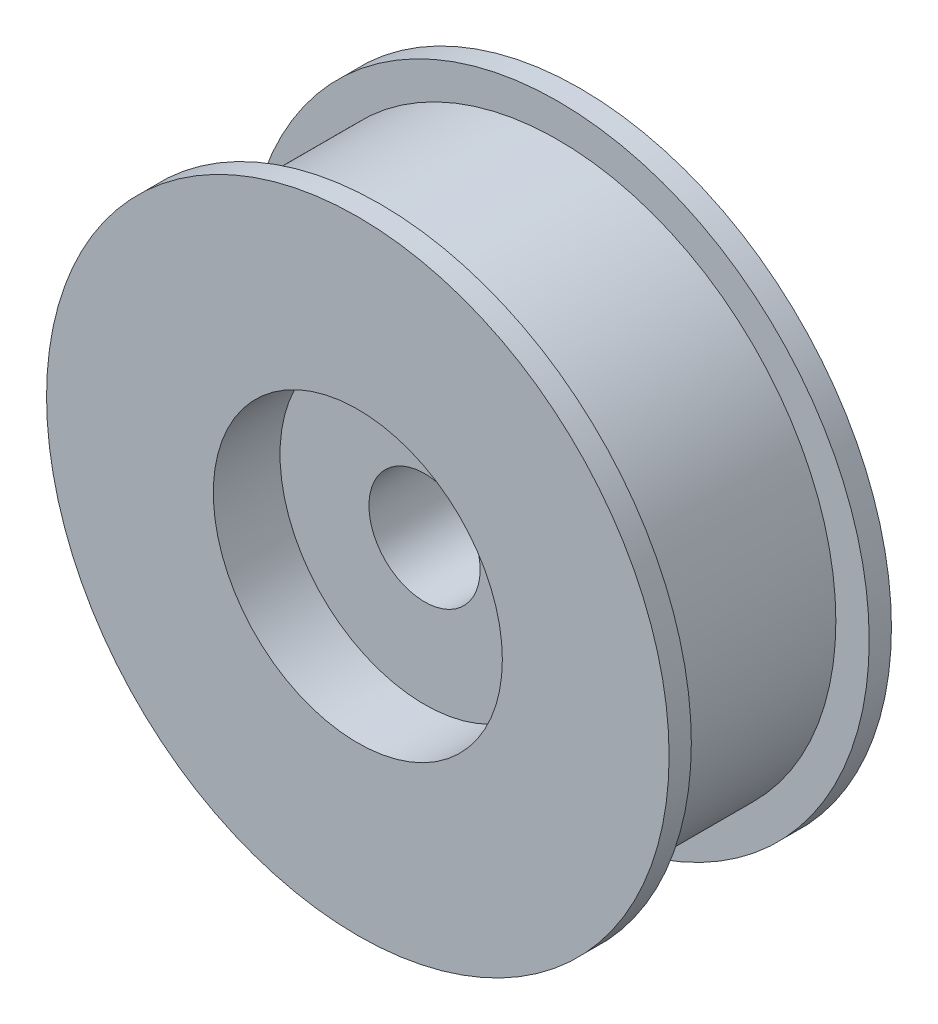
ISO-10303-21;
HEADER;
FILE_DESCRIPTION(('STEP AP214'),'2;1');
FILE_NAME('part.step','',(''),(''),'','','');
FILE_SCHEMA(('AUTOMOTIVE_DESIGN { 1 0 10303 214 1 1 1 1 }'));
ENDSEC;
DATA;
#1=APPLICATION_CONTEXT('core data for automotive mechanical design processes');
#2=APPLICATION_PROTOCOL_DEFINITION('international standard','automotive_design',2000,#1);
#3=PRODUCT_CONTEXT('',#1,'mechanical');
#4=PRODUCT('Part','Part','',(#3));
#5=PRODUCT_RELATED_PRODUCT_CATEGORY('part','',(#4));
#6=PRODUCT_DEFINITION_FORMATION('','',#4);
#7=PRODUCT_DEFINITION_CONTEXT('part definition',#1,'design');
#8=PRODUCT_DEFINITION('design','',#6,#7);
#9=PRODUCT_DEFINITION_SHAPE('','',#8);
#10=(LENGTH_UNIT() NAMED_UNIT(*) SI_UNIT(.MILLI.,.METRE.));
#11=(NAMED_UNIT(*) PLANE_ANGLE_UNIT() SI_UNIT($,.RADIAN.));
#12=(NAMED_UNIT(*) SI_UNIT($,.STERADIAN.) SOLID_ANGLE_UNIT());
#13=UNCERTAINTY_MEASURE_WITH_UNIT(LENGTH_MEASURE(1.E-05),#10,'distance_accuracy_value','');
#14=(GEOMETRIC_REPRESENTATION_CONTEXT(3) GLOBAL_UNCERTAINTY_ASSIGNED_CONTEXT((#13)) GLOBAL_UNIT_ASSIGNED_CONTEXT((#10,
#11,#12)) REPRESENTATION_CONTEXT('',''));
#15=CARTESIAN_POINT('',(0.,0.,0.));
#16=DIRECTION('',(0.,0.,1.));
#17=DIRECTION('',(1.,0.,0.));
#18=AXIS2_PLACEMENT_3D('',#15,#16,#17);
#19=CARTESIAN_POINT('',(0.,0.,20.3646380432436));
#20=DIRECTION('',(0.,0.,1.));
#21=DIRECTION('',(1.,0.,0.));
#22=AXIS2_PLACEMENT_3D('',#19,#20,#21);
#23=CYLINDRICAL_SURFACE('',#22,11.);
#24=CARTESIAN_POINT('',(0.,0.,-10.));
#25=DIRECTION('',(0.,0.,1.));
#26=DIRECTION('',(1.,0.,0.));
#27=AXIS2_PLACEMENT_3D('',#24,#25,#26);
#28=CIRCLE('',#27,11.);
#29=CARTESIAN_POINT('',(11.,0.,-10.));
#30=VERTEX_POINT('',#29);
#31=EDGE_CURVE('E8',#30,#30,#28,.T.);
#32=ORIENTED_EDGE('',*,*,#31,.F.);
#33=EDGE_LOOP('',(#32));
#34=FACE_BOUND('',#33,.T.);
#35=CARTESIAN_POINT('',(0.,0.,-4.));
#36=DIRECTION('',(0.,0.,1.));
#37=DIRECTION('',(1.,0.,0.));
#38=AXIS2_PLACEMENT_3D('',#35,#36,#37);
#39=CIRCLE('',#38,11.);
#40=CARTESIAN_POINT('',(11.,0.,-4.));
#41=VERTEX_POINT('',#40);
#42=EDGE_CURVE('E52',#41,#41,#39,.T.);
#43=ORIENTED_EDGE('',*,*,#42,.T.);
#44=EDGE_LOOP('',(#43));
#45=FACE_BOUND('',#44,.T.);
#46=ADVANCED_FACE('F12',(#34,#45),#23,.F.);
#47=CARTESIAN_POINT('',(0.,11.,-10.));
#48=DIRECTION('',(0.,0.,1.));
#49=DIRECTION('',(1.,0.,0.));
#50=AXIS2_PLACEMENT_3D('',#47,#48,#49);
#51=PLANE('',#50);
#52=CARTESIAN_POINT('',(0.,0.,-10.));
#53=DIRECTION('',(0.,0.,1.));
#54=DIRECTION('',(1.,0.,0.));
#55=AXIS2_PLACEMENT_3D('',#52,#53,#54);
#56=CIRCLE('',#55,28.);
#57=CARTESIAN_POINT('',(28.,0.,-10.));
#58=VERTEX_POINT('',#57);
#59=EDGE_CURVE('E18',#58,#58,#56,.T.);
#60=ORIENTED_EDGE('',*,*,#59,.F.);
#61=EDGE_LOOP('',(#60));
#62=FACE_BOUND('',#61,.T.);
#63=ORIENTED_EDGE('',*,*,#31,.T.);
#64=EDGE_LOOP('',(#63));
#65=FACE_BOUND('',#64,.T.);
#66=ADVANCED_FACE('F113',(#62,#65),#51,.F.);
#67=CARTESIAN_POINT('',(0.,0.,20.3646380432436));
#68=DIRECTION('',(0.,0.,1.));
#69=DIRECTION('',(1.,0.,0.));
#70=AXIS2_PLACEMENT_3D('',#67,#68,#69);
#71=CYLINDRICAL_SURFACE('',#70,28.);
#72=CARTESIAN_POINT('',(0.,0.,-8.));
#73=DIRECTION('',(0.,0.,1.));
#74=DIRECTION('',(1.,0.,0.));
#75=AXIS2_PLACEMENT_3D('',#72,#73,#74);
#76=CIRCLE('',#75,28.);
#77=CARTESIAN_POINT('',(28.,0.,-8.));
#78=VERTEX_POINT('',#77);
#79=EDGE_CURVE('E22',#78,#78,#76,.T.);
#80=ORIENTED_EDGE('',*,*,#79,.F.);
#81=EDGE_LOOP('',(#80));
#82=FACE_BOUND('',#81,.T.);
#83=ORIENTED_EDGE('',*,*,#59,.T.);
#84=EDGE_LOOP('',(#83));
#85=FACE_BOUND('',#84,.T.);
#86=ADVANCED_FACE('F108',(#82,#85),#71,.T.);
#87=CARTESIAN_POINT('',(0.,28.,-8.));
#88=DIRECTION('',(0.,0.,-1.));
#89=DIRECTION('',(-1.,0.,0.));
#90=AXIS2_PLACEMENT_3D('',#87,#88,#89);
#91=PLANE('',#90);
#92=CARTESIAN_POINT('',(0.,0.,-8.));
#93=DIRECTION('',(0.,0.,1.));
#94=DIRECTION('',(1.,0.,0.));
#95=AXIS2_PLACEMENT_3D('',#92,#93,#94);
#96=CIRCLE('',#95,25.);
#97=CARTESIAN_POINT('',(25.,0.,-8.));
#98=VERTEX_POINT('',#97);
#99=EDGE_CURVE('E26',#98,#98,#96,.T.);
#100=ORIENTED_EDGE('',*,*,#99,.F.);
#101=EDGE_LOOP('',(#100));
#102=FACE_BOUND('',#101,.T.);
#103=ORIENTED_EDGE('',*,*,#79,.T.);
#104=EDGE_LOOP('',(#103));
#105=FACE_BOUND('',#104,.T.);
#106=ADVANCED_FACE('F102',(#102,#105),#91,.F.);
#107=CARTESIAN_POINT('',(0.,0.,20.3646380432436));
#108=DIRECTION('',(0.,0.,1.));
#109=DIRECTION('',(1.,0.,0.));
#110=AXIS2_PLACEMENT_3D('',#107,#108,#109);
#111=CYLINDRICAL_SURFACE('',#110,25.);
#112=CARTESIAN_POINT('',(0.,0.,8.));
#113=DIRECTION('',(0.,0.,1.));
#114=DIRECTION('',(1.,0.,0.));
#115=AXIS2_PLACEMENT_3D('',#112,#113,#114);
#116=CIRCLE('',#115,25.);
#117=CARTESIAN_POINT('',(25.,0.,8.));
#118=VERTEX_POINT('',#117);
#119=EDGE_CURVE('E31',#118,#118,#116,.T.);
#120=ORIENTED_EDGE('',*,*,#119,.F.);
#121=EDGE_LOOP('',(#120));
#122=FACE_BOUND('',#121,.T.);
#123=ORIENTED_EDGE('',*,*,#99,.T.);
#124=EDGE_LOOP('',(#123));
#125=FACE_BOUND('',#124,.T.);
#126=ADVANCED_FACE('F96',(#122,#125),#111,.T.);
#127=CARTESIAN_POINT('',(0.,25.,8.));
#128=DIRECTION('',(0.,0.,1.));
#129=DIRECTION('',(1.,0.,0.));
#130=AXIS2_PLACEMENT_3D('',#127,#128,#129);
#131=PLANE('',#130);
#132=CARTESIAN_POINT('',(0.,0.,8.));
#133=DIRECTION('',(0.,0.,1.));
#134=DIRECTION('',(1.,0.,0.));
#135=AXIS2_PLACEMENT_3D('',#132,#133,#134);
#136=CIRCLE('',#135,28.);
#137=CARTESIAN_POINT('',(28.,0.,8.));
#138=VERTEX_POINT('',#137);
#139=EDGE_CURVE('E34',#138,#138,#136,.T.);
#140=ORIENTED_EDGE('',*,*,#139,.F.);
#141=EDGE_LOOP('',(#140));
#142=FACE_BOUND('',#141,.T.);
#143=ORIENTED_EDGE('',*,*,#119,.T.);
#144=EDGE_LOOP('',(#143));
#145=FACE_BOUND('',#144,.T.);
#146=ADVANCED_FACE('F90',(#142,#145),#131,.F.);
#147=CARTESIAN_POINT('',(0.,0.,20.3646380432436));
#148=DIRECTION('',(0.,0.,1.));
#149=DIRECTION('',(1.,0.,0.));
#150=AXIS2_PLACEMENT_3D('',#147,#148,#149);
#151=CYLINDRICAL_SURFACE('',#150,28.);
#152=CARTESIAN_POINT('',(0.,0.,10.));
#153=DIRECTION('',(0.,0.,1.));
#154=DIRECTION('',(1.,0.,0.));
#155=AXIS2_PLACEMENT_3D('',#152,#153,#154);
#156=CIRCLE('',#155,28.);
#157=CARTESIAN_POINT('',(28.,0.,10.));
#158=VERTEX_POINT('',#157);
#159=EDGE_CURVE('E37',#158,#158,#156,.T.);
#160=ORIENTED_EDGE('',*,*,#159,.F.);
#161=EDGE_LOOP('',(#160));
#162=FACE_BOUND('',#161,.T.);
#163=ORIENTED_EDGE('',*,*,#139,.T.);
#164=EDGE_LOOP('',(#163));
#165=FACE_BOUND('',#164,.T.);
#166=ADVANCED_FACE('F84',(#162,#165),#151,.T.);
#167=CARTESIAN_POINT('',(0.,28.,10.));
#168=DIRECTION('',(0.,0.,-1.));
#169=DIRECTION('',(-1.,0.,0.));
#170=AXIS2_PLACEMENT_3D('',#167,#168,#169);
#171=PLANE('',#170);
#172=CARTESIAN_POINT('',(0.,0.,10.));
#173=DIRECTION('',(0.,0.,1.));
#174=DIRECTION('',(1.,0.,0.));
#175=AXIS2_PLACEMENT_3D('',#172,#173,#174);
#176=CIRCLE('',#175,13.);
#177=CARTESIAN_POINT('',(13.,0.,10.));
#178=VERTEX_POINT('',#177);
#179=EDGE_CURVE('E40',#178,#178,#176,.T.);
#180=ORIENTED_EDGE('',*,*,#179,.F.);
#181=EDGE_LOOP('',(#180));
#182=FACE_BOUND('',#181,.T.);
#183=ORIENTED_EDGE('',*,*,#159,.T.);
#184=EDGE_LOOP('',(#183));
#185=FACE_BOUND('',#184,.T.);
#186=ADVANCED_FACE('F78',(#182,#185),#171,.F.);
#187=CARTESIAN_POINT('',(0.,0.,20.3646380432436));
#188=DIRECTION('',(0.,0.,1.));
#189=DIRECTION('',(1.,0.,0.));
#190=AXIS2_PLACEMENT_3D('',#187,#188,#189);
#191=CYLINDRICAL_SURFACE('',#190,13.);
#192=CARTESIAN_POINT('',(0.,0.,4.));
#193=DIRECTION('',(0.,0.,1.));
#194=DIRECTION('',(1.,0.,0.));
#195=AXIS2_PLACEMENT_3D('',#192,#193,#194);
#196=CIRCLE('',#195,13.);
#197=CARTESIAN_POINT('',(13.,0.,4.));
#198=VERTEX_POINT('',#197);
#199=EDGE_CURVE('E43',#198,#198,#196,.T.);
#200=ORIENTED_EDGE('',*,*,#199,.F.);
#201=EDGE_LOOP('',(#200));
#202=FACE_BOUND('',#201,.T.);
#203=ORIENTED_EDGE('',*,*,#179,.T.);
#204=EDGE_LOOP('',(#203));
#205=FACE_BOUND('',#204,.T.);
#206=ADVANCED_FACE('F72',(#202,#205),#191,.F.);
#207=CARTESIAN_POINT('',(0.,13.,4.));
#208=DIRECTION('',(0.,0.,-1.));
#209=DIRECTION('',(-1.,0.,0.));
#210=AXIS2_PLACEMENT_3D('',#207,#208,#209);
#211=PLANE('',#210);
#212=CARTESIAN_POINT('',(0.,0.,4.));
#213=DIRECTION('',(0.,0.,1.));
#214=DIRECTION('',(1.,0.,0.));
#215=AXIS2_PLACEMENT_3D('',#212,#213,#214);
#216=CIRCLE('',#215,5.);
#217=CARTESIAN_POINT('',(5.,0.,4.));
#218=VERTEX_POINT('',#217);
#219=EDGE_CURVE('E46',#218,#218,#216,.T.);
#220=ORIENTED_EDGE('',*,*,#219,.F.);
#221=EDGE_LOOP('',(#220));
#222=FACE_BOUND('',#221,.T.);
#223=ORIENTED_EDGE('',*,*,#199,.T.);
#224=EDGE_LOOP('',(#223));
#225=FACE_BOUND('',#224,.T.);
#226=ADVANCED_FACE('F66',(#222,#225),#211,.F.);
#227=CARTESIAN_POINT('',(0.,0.,20.3646380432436));
#228=DIRECTION('',(0.,0.,1.));
#229=DIRECTION('',(1.,0.,0.));
#230=AXIS2_PLACEMENT_3D('',#227,#228,#229);
#231=CYLINDRICAL_SURFACE('',#230,5.);
#232=CARTESIAN_POINT('',(0.,0.,-4.));
#233=DIRECTION('',(0.,0.,1.));
#234=DIRECTION('',(1.,0.,0.));
#235=AXIS2_PLACEMENT_3D('',#232,#233,#234);
#236=CIRCLE('',#235,5.);
#237=CARTESIAN_POINT('',(5.,0.,-4.));
#238=VERTEX_POINT('',#237);
#239=EDGE_CURVE('E49',#238,#238,#236,.T.);
#240=ORIENTED_EDGE('',*,*,#239,.F.);
#241=EDGE_LOOP('',(#240));
#242=FACE_BOUND('',#241,.T.);
#243=ORIENTED_EDGE('',*,*,#219,.T.);
#244=EDGE_LOOP('',(#243));
#245=FACE_BOUND('',#244,.T.);
#246=ADVANCED_FACE('F60',(#242,#245),#231,.F.);
#247=CARTESIAN_POINT('',(0.,5.,-4.));
#248=DIRECTION('',(0.,0.,1.));
#249=DIRECTION('',(1.,0.,0.));
#250=AXIS2_PLACEMENT_3D('',#247,#248,#249);
#251=PLANE('',#250);
#252=ORIENTED_EDGE('',*,*,#42,.F.);
#253=EDGE_LOOP('',(#252));
#254=FACE_BOUND('',#253,.T.);
#255=ORIENTED_EDGE('',*,*,#239,.T.);
#256=EDGE_LOOP('',(#255));
#257=FACE_BOUND('',#256,.T.);
#258=ADVANCED_FACE('F57',(#254,#257),#251,.F.);
#259=CLOSED_SHELL('',(#46,#66,#86,#106,#126,#146,#166,#186,#206,#226,#246,#258));
#260=MANIFOLD_SOLID_BREP('B1',#259);
#261=ADVANCED_BREP_SHAPE_REPRESENTATION('',(#18,#260),#14);
#262=SHAPE_DEFINITION_REPRESENTATION(#9,#261);
ENDSEC;
END-ISO-10303-21;
